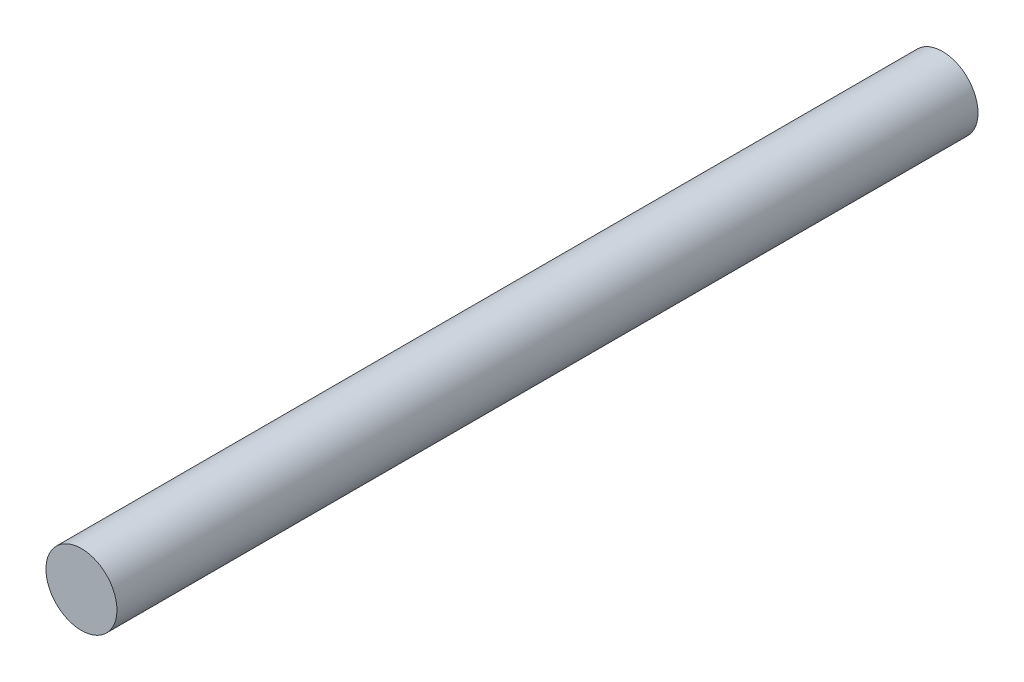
ISO-10303-21;
HEADER;
FILE_DESCRIPTION(('STEP AP214'),'2;1');
FILE_NAME('part.step','',(''),(''),'','','');
FILE_SCHEMA(('AUTOMOTIVE_DESIGN { 1 0 10303 214 1 1 1 1 }'));
ENDSEC;
DATA;
#1=APPLICATION_CONTEXT('core data for automotive mechanical design processes');
#2=APPLICATION_PROTOCOL_DEFINITION('international standard','automotive_design',2000,#1);
#3=PRODUCT_CONTEXT('',#1,'mechanical');
#4=PRODUCT('Part','Part','',(#3));
#5=PRODUCT_RELATED_PRODUCT_CATEGORY('part','',(#4));
#6=PRODUCT_DEFINITION_FORMATION('','',#4);
#7=PRODUCT_DEFINITION_CONTEXT('part definition',#1,'design');
#8=PRODUCT_DEFINITION('design','',#6,#7);
#9=PRODUCT_DEFINITION_SHAPE('','',#8);
#10=(LENGTH_UNIT() NAMED_UNIT(*) SI_UNIT(.MILLI.,.METRE.));
#11=(NAMED_UNIT(*) PLANE_ANGLE_UNIT() SI_UNIT($,.RADIAN.));
#12=(NAMED_UNIT(*) SI_UNIT($,.STERADIAN.) SOLID_ANGLE_UNIT());
#13=UNCERTAINTY_MEASURE_WITH_UNIT(LENGTH_MEASURE(1.E-05),#10,'distance_accuracy_value','');
#14=(GEOMETRIC_REPRESENTATION_CONTEXT(3) GLOBAL_UNCERTAINTY_ASSIGNED_CONTEXT((#13)) GLOBAL_UNIT_ASSIGNED_CONTEXT((#10,
#11,#12)) REPRESENTATION_CONTEXT('',''));
#15=CARTESIAN_POINT('',(0.,0.,0.));
#16=DIRECTION('',(0.,0.,1.));
#17=DIRECTION('',(1.,0.,0.));
#18=AXIS2_PLACEMENT_3D('',#15,#16,#17);
#19=CARTESIAN_POINT('',(0.,0.,0.));
#20=DIRECTION('',(0.,0.,1.));
#21=DIRECTION('',(1.,0.,0.));
#22=AXIS2_PLACEMENT_3D('',#19,#20,#21);
#23=CYLINDRICAL_SURFACE('',#22,2.);
#24=CARTESIAN_POINT('',(0.,0.,0.));
#25=DIRECTION('',(0.,0.,1.));
#26=DIRECTION('',(1.,0.,0.));
#27=AXIS2_PLACEMENT_3D('',#24,#25,#26);
#28=CIRCLE('',#27,2.);
#29=CARTESIAN_POINT('',(2.,0.,0.));
#30=VERTEX_POINT('',#29);
#31=EDGE_CURVE('E8',#30,#30,#28,.T.);
#32=ORIENTED_EDGE('',*,*,#31,.T.);
#33=EDGE_LOOP('',(#32));
#34=FACE_BOUND('',#33,.T.);
#35=CARTESIAN_POINT('',(0.,0.,48.5));
#36=DIRECTION('',(0.,0.,1.));
#37=DIRECTION('',(1.,0.,0.));
#38=AXIS2_PLACEMENT_3D('',#35,#36,#37);
#39=CIRCLE('',#38,2.);
#40=CARTESIAN_POINT('',(2.,0.,48.5));
#41=VERTEX_POINT('',#40);
#42=EDGE_CURVE('E18',#41,#41,#39,.T.);
#43=ORIENTED_EDGE('',*,*,#42,.F.);
#44=EDGE_LOOP('',(#43));
#45=FACE_BOUND('',#44,.T.);
#46=ADVANCED_FACE('F12',(#34,#45),#23,.T.);
#47=CARTESIAN_POINT('',(0.,0.,0.));
#48=DIRECTION('',(0.,0.,1.));
#49=DIRECTION('',(1.,0.,0.));
#50=AXIS2_PLACEMENT_3D('',#47,#48,#49);
#51=PLANE('',#50);
#52=ORIENTED_EDGE('',*,*,#31,.F.);
#53=EDGE_LOOP('',(#52));
#54=FACE_BOUND('',#53,.T.);
#55=ADVANCED_FACE('F27',(#54),#51,.F.);
#56=CARTESIAN_POINT('',(0.,0.,48.5));
#57=DIRECTION('',(0.,0.,1.));
#58=DIRECTION('',(1.,0.,0.));
#59=AXIS2_PLACEMENT_3D('',#56,#57,#58);
#60=PLANE('',#59);
#61=ORIENTED_EDGE('',*,*,#42,.T.);
#62=EDGE_LOOP('',(#61));
#63=FACE_BOUND('',#62,.T.);
#64=ADVANCED_FACE('F24',(#63),#60,.T.);
#65=CLOSED_SHELL('',(#46,#55,#64));
#66=MANIFOLD_SOLID_BREP('B1',#65);
#67=ADVANCED_BREP_SHAPE_REPRESENTATION('',(#18,#66),#14);
#68=SHAPE_DEFINITION_REPRESENTATION(#9,#67);
ENDSEC;
END-ISO-10303-21;
